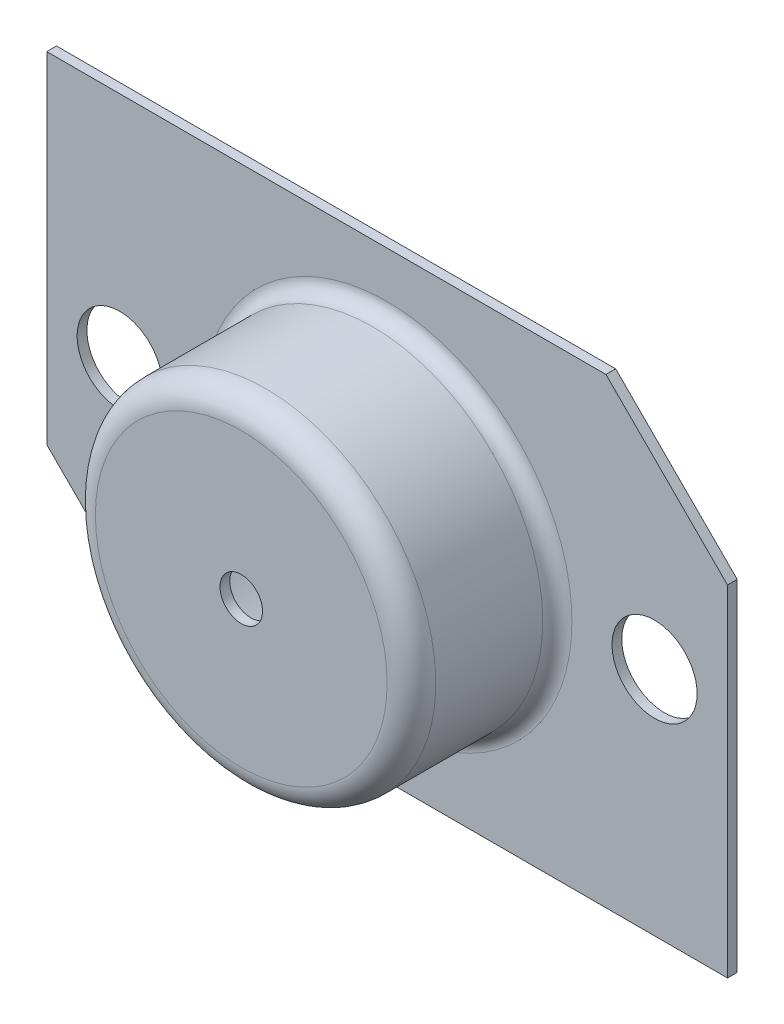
ISO-10303-21;
HEADER;
FILE_DESCRIPTION(('STEP AP214'),'2;1');
FILE_NAME('part.step','',(''),(''),'','','');
FILE_SCHEMA(('AUTOMOTIVE_DESIGN { 1 0 10303 214 1 1 1 1 }'));
ENDSEC;
DATA;
#1=APPLICATION_CONTEXT('core data for automotive mechanical design processes');
#2=APPLICATION_PROTOCOL_DEFINITION('international standard','automotive_design',2000,#1);
#3=PRODUCT_CONTEXT('',#1,'mechanical');
#4=PRODUCT('Part','Part','',(#3));
#5=PRODUCT_RELATED_PRODUCT_CATEGORY('part','',(#4));
#6=PRODUCT_DEFINITION_FORMATION('','',#4);
#7=PRODUCT_DEFINITION_CONTEXT('part definition',#1,'design');
#8=PRODUCT_DEFINITION('design','',#6,#7);
#9=PRODUCT_DEFINITION_SHAPE('','',#8);
#10=(LENGTH_UNIT() NAMED_UNIT(*) SI_UNIT(.MILLI.,.METRE.));
#11=(NAMED_UNIT(*) PLANE_ANGLE_UNIT() SI_UNIT($,.RADIAN.));
#12=(NAMED_UNIT(*) SI_UNIT($,.STERADIAN.) SOLID_ANGLE_UNIT());
#13=UNCERTAINTY_MEASURE_WITH_UNIT(LENGTH_MEASURE(1.E-05),#10,'distance_accuracy_value','');
#14=(GEOMETRIC_REPRESENTATION_CONTEXT(3) GLOBAL_UNCERTAINTY_ASSIGNED_CONTEXT((#13)) GLOBAL_UNIT_ASSIGNED_CONTEXT((#10,
#11,#12)) REPRESENTATION_CONTEXT('',''));
#15=CARTESIAN_POINT('',(0.,0.,0.));
#16=DIRECTION('',(0.,0.,1.));
#17=DIRECTION('',(1.,0.,0.));
#18=AXIS2_PLACEMENT_3D('',#15,#16,#17);
#19=CARTESIAN_POINT('',(5.99999999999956,-1.99999999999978,0.799999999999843));
#20=DIRECTION('',(0.,0.,1.));
#21=DIRECTION('',(1.,0.,0.));
#22=AXIS2_PLACEMENT_3D('',#19,#20,#21);
#23=PLANE('',#22);
#24=CARTESIAN_POINT('',(-22.0000000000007,-20.9999999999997,0.79999999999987));
#25=DIRECTION('',(0.,0.,1.));
#26=DIRECTION('',(1.,0.,0.));
#27=AXIS2_PLACEMENT_3D('',#24,#25,#26);
#28=CIRCLE('',#27,15.2);
#29=CARTESIAN_POINT('',(-6.80000000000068,-20.9999999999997,0.799999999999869));
#30=VERTEX_POINT('',#29);
#31=EDGE_CURVE('E143',#30,#30,#28,.F.);
#32=ORIENTED_EDGE('',*,*,#31,.T.);
#33=EDGE_LOOP('',(#32));
#34=FACE_BOUND('',#33,.T.);
#35=CARTESIAN_POINT('',(0.,-21.0000000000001,0.800000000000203));
#36=DIRECTION('',(0.,0.,1.));
#37=DIRECTION('',(1.,0.,0.));
#38=AXIS2_PLACEMENT_3D('',#35,#36,#37);
#39=CIRCLE('',#38,3.5);
#40=CARTESIAN_POINT('',(3.5,-21.0000000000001,0.800000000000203));
#41=VERTEX_POINT('',#40);
#42=EDGE_CURVE('E239',#41,#41,#39,.T.);
#43=ORIENTED_EDGE('',*,*,#42,.F.);
#44=EDGE_LOOP('',(#43));
#45=FACE_BOUND('',#44,.T.);
#46=DIRECTION('',(0.,-1.,0.));
#47=VECTOR('',#46,1.);
#48=CARTESIAN_POINT('',(-50.0000000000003,-40.0000000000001,0.799999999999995));
#49=LINE('',#48,#47);
#50=CARTESIAN_POINT('',(-50.0000000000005,-2.,0.799999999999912));
#51=VERTEX_POINT('',#50);
#52=CARTESIAN_POINT('',(-50.0000000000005,-30.0000000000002,0.799999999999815));
#53=VERTEX_POINT('',#52);
#54=EDGE_CURVE('E109',#51,#53,#49,.T.);
#55=ORIENTED_EDGE('',*,*,#54,.T.);
#56=DIRECTION('',(-0.707106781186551,0.707106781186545,0.));
#57=VECTOR('',#56,1.);
#58=CARTESIAN_POINT('',(-36.,-44.0000000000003,0.79999999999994));
#59=LINE('',#58,#57);
#60=CARTESIAN_POINT('',(-40.0000000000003,-40.,0.799999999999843));
#61=VERTEX_POINT('',#60);
#62=EDGE_CURVE('E139',#53,#61,#59,.F.);
#63=ORIENTED_EDGE('',*,*,#62,.T.);
#64=DIRECTION('',(1.,0.,0.));
#65=VECTOR('',#64,1.);
#66=CARTESIAN_POINT('',(5.99999999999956,-39.9999999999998,0.800000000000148));
#67=LINE('',#66,#65);
#68=CARTESIAN_POINT('',(5.99999999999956,-39.9999999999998,0.800000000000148));
#69=VERTEX_POINT('',#68);
#70=EDGE_CURVE('E127',#61,#69,#67,.T.);
#71=ORIENTED_EDGE('',*,*,#70,.T.);
#72=DIRECTION('',(0.,1.,0.));
#73=VECTOR('',#72,1.);
#74=CARTESIAN_POINT('',(5.99999999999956,-39.9999999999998,0.800000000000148));
#75=LINE('',#74,#73);
#76=CARTESIAN_POINT('',(5.99999999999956,-12.,0.799999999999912));
#77=VERTEX_POINT('',#76);
#78=EDGE_CURVE('E119',#69,#77,#75,.T.);
#79=ORIENTED_EDGE('',*,*,#78,.T.);
#80=DIRECTION('',(0.707106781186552,-0.707106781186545,0.));
#81=VECTOR('',#80,1.);
#82=CARTESIAN_POINT('',(0.999999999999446,-7.00000000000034,0.799999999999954));
#83=LINE('',#82,#81);
#84=CARTESIAN_POINT('',(-4.00000000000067,-2.00000000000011,0.799999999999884));
#85=VERTEX_POINT('',#84);
#86=EDGE_CURVE('E51',#77,#85,#83,.F.);
#87=ORIENTED_EDGE('',*,*,#86,.T.);
#88=DIRECTION('',(-1.,0.,0.));
#89=VECTOR('',#88,1.);
#90=CARTESIAN_POINT('',(5.99999999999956,-1.99999999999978,0.799999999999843));
#91=LINE('',#90,#89);
#92=EDGE_CURVE('E124',#85,#51,#91,.T.);
#93=ORIENTED_EDGE('',*,*,#92,.T.);
#94=EDGE_LOOP('',(#55,#63,#71,#79,#87,#93));
#95=FACE_BOUND('',#94,.T.);
#96=CARTESIAN_POINT('',(-44.0000000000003,-21.0000000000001,0.800000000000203));
#97=DIRECTION('',(0.,0.,1.));
#98=DIRECTION('',(1.,0.,0.));
#99=AXIS2_PLACEMENT_3D('',#96,#97,#98);
#100=CIRCLE('',#99,3.5);
#101=CARTESIAN_POINT('',(-40.5000000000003,-21.0000000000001,0.800000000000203));
#102=VERTEX_POINT('',#101);
#103=EDGE_CURVE('E189',#102,#102,#100,.T.);
#104=ORIENTED_EDGE('',*,*,#103,.F.);
#105=EDGE_LOOP('',(#104));
#106=FACE_BOUND('',#105,.T.);
#107=ADVANCED_FACE('F36',(#34,#45,#95,#106),#23,.T.);
#108=CARTESIAN_POINT('',(5.99999999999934,-2.00000000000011,-2.91433543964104E-13));
#109=DIRECTION('',(0.,0.,1.));
#110=DIRECTION('',(1.,0.,0.));
#111=AXIS2_PLACEMENT_3D('',#108,#109,#110);
#112=PLANE('',#111);
#113=CARTESIAN_POINT('',(-22.0000000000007,-21.0000000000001,0.));
#114=DIRECTION('',(0.,0.,1.));
#115=DIRECTION('',(1.,0.,0.));
#116=AXIS2_PLACEMENT_3D('',#113,#114,#115);
#117=CIRCLE('',#116,15.2);
#118=CARTESIAN_POINT('',(-6.80000000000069,-21.0000000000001,0.));
#119=VERTEX_POINT('',#118);
#120=EDGE_CURVE('E44',#119,#119,#117,.T.);
#121=ORIENTED_EDGE('',*,*,#120,.T.);
#122=EDGE_LOOP('',(#121));
#123=FACE_BOUND('',#122,.T.);
#124=CARTESIAN_POINT('',(-44.,-21.0000000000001,2.91433543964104E-13));
#125=DIRECTION('',(0.,0.,1.));
#126=DIRECTION('',(1.,0.,0.));
#127=AXIS2_PLACEMENT_3D('',#124,#125,#126);
#128=CIRCLE('',#127,3.5);
#129=CARTESIAN_POINT('',(-40.5,-21.0000000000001,2.91100994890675E-13));
#130=VERTEX_POINT('',#129);
#131=EDGE_CURVE('E242',#130,#130,#128,.T.);
#132=ORIENTED_EDGE('',*,*,#131,.T.);
#133=EDGE_LOOP('',(#132));
#134=FACE_BOUND('',#133,.T.);
#135=DIRECTION('',(1.,0.,0.));
#136=VECTOR('',#135,1.);
#137=CARTESIAN_POINT('',(5.99999999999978,-39.9999999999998,0.));
#138=LINE('',#137,#136);
#139=CARTESIAN_POINT('',(-40.0000000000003,-40.,0.));
#140=VERTEX_POINT('',#139);
#141=CARTESIAN_POINT('',(5.99999999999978,-39.9999999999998,0.));
#142=VERTEX_POINT('',#141);
#143=EDGE_CURVE('E117',#140,#142,#138,.T.);
#144=ORIENTED_EDGE('',*,*,#143,.F.);
#145=DIRECTION('',(0.707106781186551,-0.707106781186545,0.));
#146=VECTOR('',#145,1.);
#147=CARTESIAN_POINT('',(-40.0000000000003,-40.,0.));
#148=LINE('',#147,#146);
#149=CARTESIAN_POINT('',(-49.9999999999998,-30.0000000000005,0.));
#150=VERTEX_POINT('',#149);
#151=EDGE_CURVE('E116',#140,#150,#148,.F.);
#152=ORIENTED_EDGE('',*,*,#151,.T.);
#153=DIRECTION('',(0.,-1.,0.));
#154=VECTOR('',#153,1.);
#155=CARTESIAN_POINT('',(-49.9999999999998,-40.0000000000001,0.));
#156=LINE('',#155,#154);
#157=CARTESIAN_POINT('',(-49.9999999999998,-2.,0.));
#158=VERTEX_POINT('',#157);
#159=EDGE_CURVE('E101',#158,#150,#156,.T.);
#160=ORIENTED_EDGE('',*,*,#159,.F.);
#161=DIRECTION('',(-1.,0.,0.));
#162=VECTOR('',#161,1.);
#163=CARTESIAN_POINT('',(5.99999999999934,-2.00000000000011,-2.91433543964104E-13));
#164=LINE('',#163,#162);
#165=CARTESIAN_POINT('',(-4.,-1.99999999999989,0.));
#166=VERTEX_POINT('',#165);
#167=EDGE_CURVE('E92',#166,#158,#164,.T.);
#168=ORIENTED_EDGE('',*,*,#167,.F.);
#169=DIRECTION('',(-0.707106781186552,0.707106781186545,0.));
#170=VECTOR('',#169,1.);
#171=CARTESIAN_POINT('',(-4.,-1.99999999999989,0.));
#172=LINE('',#171,#170);
#173=CARTESIAN_POINT('',(5.99999999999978,-12.0000000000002,0.));
#174=VERTEX_POINT('',#173);
#175=EDGE_CURVE('E133',#166,#174,#172,.F.);
#176=ORIENTED_EDGE('',*,*,#175,.T.);
#177=DIRECTION('',(0.,1.,0.));
#178=VECTOR('',#177,1.);
#179=CARTESIAN_POINT('',(5.99999999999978,-39.9999999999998,0.));
#180=LINE('',#179,#178);
#181=EDGE_CURVE('E102',#142,#174,#180,.T.);
#182=ORIENTED_EDGE('',*,*,#181,.F.);
#183=EDGE_LOOP('',(#144,#152,#160,#168,#176,#182));
#184=FACE_BOUND('',#183,.T.);
#185=CARTESIAN_POINT('',(0.,-21.0000000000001,0.));
#186=DIRECTION('',(0.,0.,1.));
#187=DIRECTION('',(1.,0.,0.));
#188=AXIS2_PLACEMENT_3D('',#185,#186,#187);
#189=CIRCLE('',#188,3.5);
#190=CARTESIAN_POINT('',(3.5,-21.0000000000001,0.));
#191=VERTEX_POINT('',#190);
#192=EDGE_CURVE('E236',#191,#191,#189,.T.);
#193=ORIENTED_EDGE('',*,*,#192,.T.);
#194=EDGE_LOOP('',(#193));
#195=FACE_BOUND('',#194,.T.);
#196=ADVANCED_FACE('F114',(#123,#134,#184,#195),#112,.F.);
#197=CARTESIAN_POINT('',(5.99999999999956,-39.9999999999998,0.800000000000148));
#198=DIRECTION('',(-1.,0.,0.));
#199=DIRECTION('',(0.,-1.,0.));
#200=AXIS2_PLACEMENT_3D('',#197,#198,#199);
#201=PLANE('',#200);
#202=ORIENTED_EDGE('',*,*,#181,.T.);
#203=DIRECTION('',(0.,0.,1.));
#204=VECTOR('',#203,1.);
#205=CARTESIAN_POINT('',(5.99999999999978,-11.9999999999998,0.800000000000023));
#206=LINE('',#205,#204);
#207=EDGE_CURVE('E59',#174,#77,#206,.T.);
#208=ORIENTED_EDGE('',*,*,#207,.T.);
#209=ORIENTED_EDGE('',*,*,#78,.F.);
#210=DIRECTION('',(0.,0.,-1.));
#211=VECTOR('',#210,1.);
#212=CARTESIAN_POINT('',(5.99999999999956,-39.9999999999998,0.800000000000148));
#213=LINE('',#212,#211);
#214=EDGE_CURVE('E111',#69,#142,#213,.T.);
#215=ORIENTED_EDGE('',*,*,#214,.T.);
#216=EDGE_LOOP('',(#202,#208,#209,#215));
#217=FACE_BOUND('',#216,.T.);
#218=ADVANCED_FACE('F38',(#217),#201,.F.);
#219=CARTESIAN_POINT('',(5.99999999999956,-1.99999999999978,0.799999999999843));
#220=DIRECTION('',(0.,-1.,0.));
#221=DIRECTION('',(1.,0.,0.));
#222=AXIS2_PLACEMENT_3D('',#219,#220,#221);
#223=PLANE('',#222);
#224=ORIENTED_EDGE('',*,*,#92,.F.);
#225=DIRECTION('',(0.,0.,-1.));
#226=VECTOR('',#225,1.);
#227=CARTESIAN_POINT('',(-4.00000000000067,-2.00000000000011,0.799999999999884));
#228=LINE('',#227,#226);
#229=EDGE_CURVE('E98',#85,#166,#228,.T.);
#230=ORIENTED_EDGE('',*,*,#229,.T.);
#231=ORIENTED_EDGE('',*,*,#167,.T.);
#232=DIRECTION('',(0.,0.,-1.));
#233=VECTOR('',#232,1.);
#234=CARTESIAN_POINT('',(-50.0000000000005,-2.,0.799999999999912));
#235=LINE('',#234,#233);
#236=EDGE_CURVE('E95',#51,#158,#235,.T.);
#237=ORIENTED_EDGE('',*,*,#236,.F.);
#238=EDGE_LOOP('',(#224,#230,#231,#237));
#239=FACE_BOUND('',#238,.T.);
#240=ADVANCED_FACE('F94',(#239),#223,.F.);
#241=CARTESIAN_POINT('',(-50.0000000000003,-40.0000000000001,0.799999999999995));
#242=DIRECTION('',(1.,0.,0.));
#243=DIRECTION('',(0.,0.,-1.));
#244=AXIS2_PLACEMENT_3D('',#241,#242,#243);
#245=PLANE('',#244);
#246=ORIENTED_EDGE('',*,*,#159,.T.);
#247=DIRECTION('',(0.,0.,1.));
#248=VECTOR('',#247,1.);
#249=CARTESIAN_POINT('',(-50.0000000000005,-30.0000000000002,0.799999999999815));
#250=LINE('',#249,#248);
#251=EDGE_CURVE('E136',#150,#53,#250,.T.);
#252=ORIENTED_EDGE('',*,*,#251,.T.);
#253=ORIENTED_EDGE('',*,*,#54,.F.);
#254=ORIENTED_EDGE('',*,*,#236,.T.);
#255=EDGE_LOOP('',(#246,#252,#253,#254));
#256=FACE_BOUND('',#255,.T.);
#257=ADVANCED_FACE('F106',(#256),#245,.F.);
#258=CARTESIAN_POINT('',(5.99999999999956,-39.9999999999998,0.800000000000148));
#259=DIRECTION('',(0.,1.,0.));
#260=DIRECTION('',(-1.,0.,0.));
#261=AXIS2_PLACEMENT_3D('',#258,#259,#260);
#262=PLANE('',#261);
#263=ORIENTED_EDGE('',*,*,#70,.F.);
#264=DIRECTION('',(0.,0.,-1.));
#265=VECTOR('',#264,1.);
#266=CARTESIAN_POINT('',(-40.0000000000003,-40.,0.799999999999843));
#267=LINE('',#266,#265);
#268=EDGE_CURVE('E110',#61,#140,#267,.T.);
#269=ORIENTED_EDGE('',*,*,#268,.T.);
#270=ORIENTED_EDGE('',*,*,#143,.T.);
#271=ORIENTED_EDGE('',*,*,#214,.F.);
#272=EDGE_LOOP('',(#263,#269,#270,#271));
#273=FACE_BOUND('',#272,.T.);
#274=ADVANCED_FACE('F175',(#273),#262,.F.);
#275=CARTESIAN_POINT('',(-22.0000000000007,-20.9999999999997,0.79999999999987));
#276=DIRECTION('',(0.,0.,-1.));
#277=DIRECTION('',(-1.,0.,0.));
#278=AXIS2_PLACEMENT_3D('',#275,#276,#277);
#279=CYLINDRICAL_SURFACE('',#278,13.2);
#280=CARTESIAN_POINT('',(-22.,-21.0000000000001,2.00000000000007));
#281=DIRECTION('',(0.,0.,1.));
#282=DIRECTION('',(1.,0.,0.));
#283=AXIS2_PLACEMENT_3D('',#280,#281,#282);
#284=CIRCLE('',#283,13.2);
#285=CARTESIAN_POINT('',(-8.80000000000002,-21.0000000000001,2.00000000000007));
#286=VERTEX_POINT('',#285);
#287=EDGE_CURVE('E11',#286,#286,#284,.F.);
#288=ORIENTED_EDGE('',*,*,#287,.T.);
#289=EDGE_LOOP('',(#288));
#290=FACE_BOUND('',#289,.T.);
#291=CARTESIAN_POINT('',(-22.0000000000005,-20.9999999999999,10.8000000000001));
#292=DIRECTION('',(0.,0.,-1.));
#293=DIRECTION('',(-1.,0.,0.));
#294=AXIS2_PLACEMENT_3D('',#291,#292,#293);
#295=CIRCLE('',#294,13.2);
#296=CARTESIAN_POINT('',(-35.2000000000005,-20.9999999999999,10.8000000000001));
#297=VERTEX_POINT('',#296);
#298=EDGE_CURVE('E221',#297,#297,#295,.T.);
#299=ORIENTED_EDGE('',*,*,#298,.F.);
#300=EDGE_LOOP('',(#299));
#301=FACE_BOUND('',#300,.T.);
#302=ADVANCED_FACE('F178',(#290,#301),#279,.F.);
#303=CARTESIAN_POINT('',(-44.0000000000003,-21.0000000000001,0.800000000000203));
#304=DIRECTION('',(0.,0.,-1.));
#305=DIRECTION('',(-1.,0.,0.));
#306=AXIS2_PLACEMENT_3D('',#303,#304,#305);
#307=CYLINDRICAL_SURFACE('',#306,3.5);
#308=ORIENTED_EDGE('',*,*,#103,.T.);
#309=EDGE_LOOP('',(#308));
#310=FACE_BOUND('',#309,.T.);
#311=ORIENTED_EDGE('',*,*,#131,.F.);
#312=EDGE_LOOP('',(#311));
#313=FACE_BOUND('',#312,.T.);
#314=ADVANCED_FACE('F210',(#310,#313),#307,.F.);
#315=CARTESIAN_POINT('',(0.,-21.0000000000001,0.800000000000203));
#316=DIRECTION('',(0.,0.,-1.));
#317=DIRECTION('',(-1.,0.,0.));
#318=AXIS2_PLACEMENT_3D('',#315,#316,#317);
#319=CYLINDRICAL_SURFACE('',#318,3.5);
#320=ORIENTED_EDGE('',*,*,#42,.T.);
#321=EDGE_LOOP('',(#320));
#322=FACE_BOUND('',#321,.T.);
#323=ORIENTED_EDGE('',*,*,#192,.F.);
#324=EDGE_LOOP('',(#323));
#325=FACE_BOUND('',#324,.T.);
#326=ADVANCED_FACE('F203',(#322,#325),#319,.F.);
#327=CARTESIAN_POINT('',(-40.0000000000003,-40.,0.799999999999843));
#328=DIRECTION('',(0.707106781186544,0.707106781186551,0.));
#329=DIRECTION('',(-0.707106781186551,0.707106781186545,0.));
#330=AXIS2_PLACEMENT_3D('',#327,#328,#329);
#331=PLANE('',#330);
#332=ORIENTED_EDGE('',*,*,#62,.F.);
#333=ORIENTED_EDGE('',*,*,#251,.F.);
#334=ORIENTED_EDGE('',*,*,#151,.F.);
#335=ORIENTED_EDGE('',*,*,#268,.F.);
#336=EDGE_LOOP('',(#332,#333,#334,#335));
#337=FACE_BOUND('',#336,.T.);
#338=ADVANCED_FACE('F194',(#337),#331,.F.);
#339=CARTESIAN_POINT('',(-4.00000000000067,-2.00000000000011,0.799999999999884));
#340=DIRECTION('',(-0.707106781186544,-0.707106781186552,0.));
#341=DIRECTION('',(0.707106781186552,-0.707106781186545,0.));
#342=AXIS2_PLACEMENT_3D('',#339,#340,#341);
#343=PLANE('',#342);
#344=ORIENTED_EDGE('',*,*,#86,.F.);
#345=ORIENTED_EDGE('',*,*,#207,.F.);
#346=ORIENTED_EDGE('',*,*,#175,.F.);
#347=ORIENTED_EDGE('',*,*,#229,.F.);
#348=EDGE_LOOP('',(#344,#345,#346,#347));
#349=FACE_BOUND('',#348,.T.);
#350=ADVANCED_FACE('F191',(#349),#343,.F.);
#351=CARTESIAN_POINT('',(-22.0000000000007,-20.9999999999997,0.79999999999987));
#352=DIRECTION('',(0.,0.,-1.));
#353=DIRECTION('',(-1.,0.,0.));
#354=AXIS2_PLACEMENT_3D('',#351,#352,#353);
#355=CYLINDRICAL_SURFACE('',#354,1.75);
#356=CARTESIAN_POINT('',(-22.0000000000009,-20.9999999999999,12.8));
#357=DIRECTION('',(0.,0.,-1.));
#358=DIRECTION('',(-1.,0.,0.));
#359=AXIS2_PLACEMENT_3D('',#356,#357,#358);
#360=CIRCLE('',#359,1.75);
#361=CARTESIAN_POINT('',(-23.7500000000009,-20.9999999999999,12.8));
#362=VERTEX_POINT('',#361);
#363=EDGE_CURVE('E286',#362,#362,#360,.T.);
#364=ORIENTED_EDGE('',*,*,#363,.F.);
#365=EDGE_LOOP('',(#364));
#366=FACE_BOUND('',#365,.T.);
#367=CARTESIAN_POINT('',(-22.0000000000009,-20.9999999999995,12.));
#368=DIRECTION('',(0.,0.,-1.));
#369=DIRECTION('',(-1.,0.,0.));
#370=AXIS2_PLACEMENT_3D('',#367,#368,#369);
#371=CIRCLE('',#370,1.75);
#372=CARTESIAN_POINT('',(-23.7500000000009,-20.9999999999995,12.));
#373=VERTEX_POINT('',#372);
#374=EDGE_CURVE('E227',#373,#373,#371,.T.);
#375=ORIENTED_EDGE('',*,*,#374,.T.);
#376=EDGE_LOOP('',(#375));
#377=FACE_BOUND('',#376,.T.);
#378=ADVANCED_FACE('F193',(#366,#377),#355,.F.);
#379=CARTESIAN_POINT('',(-23.7500000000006,-20.9999999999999,12.));
#380=DIRECTION('',(0.,0.,1.));
#381=DIRECTION('',(1.,0.,0.));
#382=AXIS2_PLACEMENT_3D('',#379,#380,#381);
#383=PLANE('',#382);
#384=ORIENTED_EDGE('',*,*,#374,.F.);
#385=EDGE_LOOP('',(#384));
#386=FACE_BOUND('',#385,.T.);
#387=CARTESIAN_POINT('',(-22.0000000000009,-20.9999999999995,12.));
#388=DIRECTION('',(0.,0.,-1.));
#389=DIRECTION('',(-1.,0.,0.));
#390=AXIS2_PLACEMENT_3D('',#387,#388,#389);
#391=CIRCLE('',#390,12.);
#392=CARTESIAN_POINT('',(-34.0000000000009,-20.9999999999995,12.));
#393=VERTEX_POINT('',#392);
#394=EDGE_CURVE('E223',#393,#393,#391,.T.);
#395=ORIENTED_EDGE('',*,*,#394,.T.);
#396=EDGE_LOOP('',(#395));
#397=FACE_BOUND('',#396,.T.);
#398=ADVANCED_FACE('F200',(#386,#397),#383,.F.);
#399=CARTESIAN_POINT('',(-22.0000000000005,-20.9999999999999,10.8000000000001));
#400=DIRECTION('',(0.,0.,-1.));
#401=DIRECTION('',(-1.,0.,0.));
#402=AXIS2_PLACEMENT_3D('',#399,#400,#401);
#403=TOROIDAL_SURFACE('',#402,12.,1.2);
#404=ORIENTED_EDGE('',*,*,#394,.F.);
#405=EDGE_LOOP('',(#404));
#406=FACE_BOUND('',#405,.T.);
#407=ORIENTED_EDGE('',*,*,#298,.T.);
#408=EDGE_LOOP('',(#407));
#409=FACE_BOUND('',#408,.T.);
#410=ADVANCED_FACE('F261',(#406,#409),#403,.F.);
#411=CARTESIAN_POINT('',(-22.0000000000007,-20.9999999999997,0.79999999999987));
#412=DIRECTION('',(0.,0.,-1.));
#413=DIRECTION('',(-1.,0.,0.));
#414=AXIS2_PLACEMENT_3D('',#411,#412,#413);
#415=CYLINDRICAL_SURFACE('',#414,14.);
#416=CARTESIAN_POINT('',(-22.,-21.0000000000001,2.00000000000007));
#417=DIRECTION('',(0.,0.,1.));
#418=DIRECTION('',(1.,0.,0.));
#419=AXIS2_PLACEMENT_3D('',#416,#417,#418);
#420=CIRCLE('',#419,14.);
#421=CARTESIAN_POINT('',(-8.00000000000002,-21.0000000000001,2.00000000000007));
#422=VERTEX_POINT('',#421);
#423=EDGE_CURVE('E146',#422,#422,#420,.T.);
#424=ORIENTED_EDGE('',*,*,#423,.T.);
#425=EDGE_LOOP('',(#424));
#426=FACE_BOUND('',#425,.T.);
#427=CARTESIAN_POINT('',(-22.0000000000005,-20.9999999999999,10.8000000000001));
#428=DIRECTION('',(0.,0.,-1.));
#429=DIRECTION('',(-1.,0.,0.));
#430=AXIS2_PLACEMENT_3D('',#427,#428,#429);
#431=CIRCLE('',#430,14.);
#432=CARTESIAN_POINT('',(-36.0000000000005,-20.9999999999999,10.8000000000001));
#433=VERTEX_POINT('',#432);
#434=EDGE_CURVE('E224',#433,#433,#431,.T.);
#435=ORIENTED_EDGE('',*,*,#434,.T.);
#436=EDGE_LOOP('',(#435));
#437=FACE_BOUND('',#436,.T.);
#438=ADVANCED_FACE('F265',(#426,#437),#415,.T.);
#439=CARTESIAN_POINT('',(-22.0000000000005,-20.9999999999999,10.8000000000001));
#440=DIRECTION('',(0.,0.,-1.));
#441=DIRECTION('',(-1.,0.,0.));
#442=AXIS2_PLACEMENT_3D('',#439,#440,#441);
#443=TOROIDAL_SURFACE('',#442,12.,2.);
#444=ORIENTED_EDGE('',*,*,#434,.F.);
#445=EDGE_LOOP('',(#444));
#446=FACE_BOUND('',#445,.T.);
#447=CARTESIAN_POINT('',(-22.0000000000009,-20.9999999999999,12.8));
#448=DIRECTION('',(0.,0.,-1.));
#449=DIRECTION('',(-1.,0.,0.));
#450=AXIS2_PLACEMENT_3D('',#447,#448,#449);
#451=CIRCLE('',#450,12.);
#452=CARTESIAN_POINT('',(-34.0000000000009,-20.9999999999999,12.8));
#453=VERTEX_POINT('',#452);
#454=EDGE_CURVE('E230',#453,#453,#451,.T.);
#455=ORIENTED_EDGE('',*,*,#454,.T.);
#456=EDGE_LOOP('',(#455));
#457=FACE_BOUND('',#456,.T.);
#458=ADVANCED_FACE('F270',(#446,#457),#443,.T.);
#459=CARTESIAN_POINT('',(-23.7500000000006,-21.,12.8000000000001));
#460=DIRECTION('',(0.,0.,-1.));
#461=DIRECTION('',(-1.,0.,0.));
#462=AXIS2_PLACEMENT_3D('',#459,#460,#461);
#463=PLANE('',#462);
#464=ORIENTED_EDGE('',*,*,#454,.F.);
#465=EDGE_LOOP('',(#464));
#466=FACE_BOUND('',#465,.T.);
#467=ORIENTED_EDGE('',*,*,#363,.T.);
#468=EDGE_LOOP('',(#467));
#469=FACE_BOUND('',#468,.T.);
#470=ADVANCED_FACE('F161',(#466,#469),#463,.F.);
#471=CARTESIAN_POINT('',(-22.,-21.0000000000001,2.00000000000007));
#472=DIRECTION('',(0.,0.,1.));
#473=DIRECTION('',(1.,0.,0.));
#474=AXIS2_PLACEMENT_3D('',#471,#472,#473);
#475=TOROIDAL_SURFACE('',#474,15.2,1.2);
#476=ORIENTED_EDGE('',*,*,#423,.F.);
#477=EDGE_LOOP('',(#476));
#478=FACE_BOUND('',#477,.T.);
#479=ORIENTED_EDGE('',*,*,#31,.F.);
#480=EDGE_LOOP('',(#479));
#481=FACE_BOUND('',#480,.T.);
#482=ADVANCED_FACE('F155',(#478,#481),#475,.F.);
#483=CARTESIAN_POINT('',(-22.,-21.0000000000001,2.00000000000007));
#484=DIRECTION('',(0.,0.,1.));
#485=DIRECTION('',(1.,0.,0.));
#486=AXIS2_PLACEMENT_3D('',#483,#484,#485);
#487=TOROIDAL_SURFACE('',#486,15.2,2.);
#488=ORIENTED_EDGE('',*,*,#287,.F.);
#489=EDGE_LOOP('',(#488));
#490=FACE_BOUND('',#489,.T.);
#491=ORIENTED_EDGE('',*,*,#120,.F.);
#492=EDGE_LOOP('',(#491));
#493=FACE_BOUND('',#492,.T.);
#494=ADVANCED_FACE('F153',(#490,#493),#487,.T.);
#495=CLOSED_SHELL('',(#107,#196,#218,#240,#257,#274,#302,#314,#326,#338,#350,#378,#398,#410,
#438,#458,#470,#482,#494));
#496=MANIFOLD_SOLID_BREP('B2',#495);
#497=ADVANCED_BREP_SHAPE_REPRESENTATION('',(#18,#496),#14);
#498=SHAPE_DEFINITION_REPRESENTATION(#9,#497);
ENDSEC;
END-ISO-10303-21;
